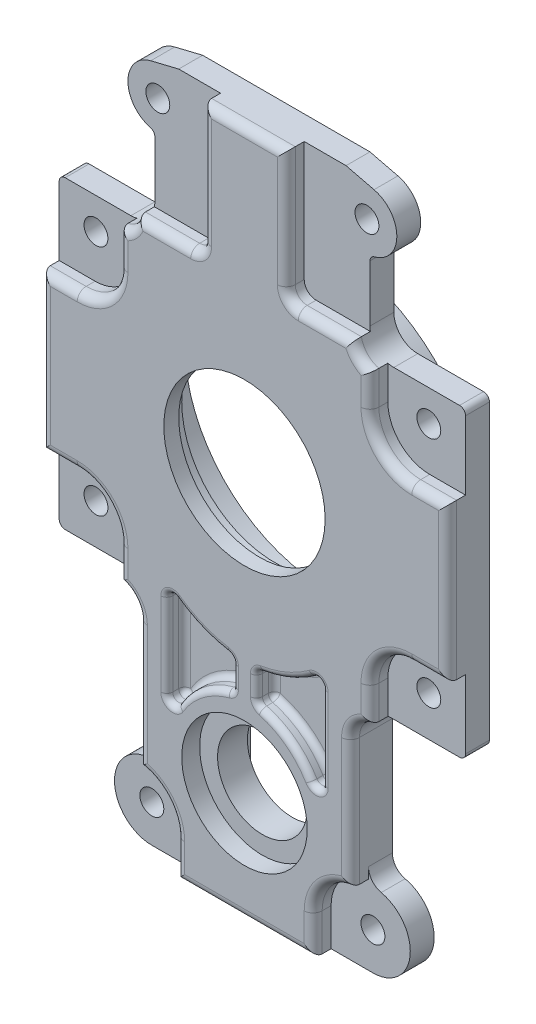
from build123d import *

# Parameters (mm, degrees)
ESQUISSE1_R             = 2
BASE_EXTRUSION_DEPTH    = 3
ESQUISSE2_R             = 10.5
BOSS_EXTRU_1_DEPTH      = 3
CONG_1_R                = 1.5
CONG_2_R                = 1
ESQUISSE6_R             = 26.25
BOSS_EXTRU_2_DEPTH      = 7.5
BOSS_EXTRU_3_DEPTH      = 2
ESQUISSE10_W            = 2
ESQUISSE10_H            = 18
BOSS_EXTRU_4_DEPTH      = 3
PER_AGE1_D              = 14
PER_AGE1_CBORE_D        = 15
PER_AGE1_CBORE_DEPTH    = 32
CONG_3_R                = 1
BOSS_EXTRU_5_START      = 1
BOSS_EXTRU_5_DEPTH      = 1
ESQUISSE12_R            = 2
ENL_V_MAT_EXTRU_1_DEPTH = 120.424662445


with BuildPart() as part:
    # Esquisse1 → Base-Extrusion (new body)
    with BuildSketch(Plane.XY):
        with BuildLine():
            Line((18, 92.75), (18, 102.190524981))
            ThreePointArc((18, 102.190524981), (18.209430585, 102.802897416), (18.75, 103.158770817))
            ThreePointArc((18.75, 103.158770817), (22.499886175, 108.033737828), (18.684554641, 112.857656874))
            Line((18.684554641, 112.857656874), (14, 114))
            Line((14, 114), (0, 114))
            Line((0, 114), (-14, 114))
            Line((-14, 114), (-18.684554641, 112.857656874))
            ThreePointArc((-18.684554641, 112.857656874), (-22.499886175, 108.033737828), (-18.75, 103.158770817))
            ThreePointArc((-18.75, 103.158770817), (-18.209430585, 102.802897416), (-18, 102.190524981))
            Line((-18, 102.190524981), (-18, 92.75))
            ThreePointArc((-18, 92.75), (-19.171572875, 89.921572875), (-22, 88.75))
            Line((-22, 88.75), (-33, 88.75))
            ThreePointArc((-33, 88.75), (-33.707106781, 88.457106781), (-34, 87.75))
            Line((-34, 87.75), (-34, 38.75))
            ThreePointArc((-34, 38.75), (-33.707106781, 38.042893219), (-33, 37.75))
            Line((-33, 37.75), (-30.5, 37.75))
            Line((-30.5, 37.75), (-21.75, 37.75))
            ThreePointArc((-21.75, 37.75), (-18.921572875, 36.578427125), (-17.75, 33.75))
            Line((-17.75, 33.75), (-17.75, 14.274964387))
            ThreePointArc((-17.75, 14.274964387), (-18.35022611, 12.560038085), (-19.888888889, 11.593725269))
            ThreePointArc((-19.888888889, 11.593725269), (-24.710808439, 4.801173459), (-18.5, -0.75))
            Line((-18.5, -0.75), (18.5, -0.75))
            ThreePointArc((18.5, -0.75), (24.710808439, 4.801173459), (19.888888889, 11.593725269))
            ThreePointArc((19.888888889, 11.593725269), (18.35022611, 12.560038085), (17.75, 14.274964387))
            Line((17.75, 14.274964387), (17.75, 33.75))
            ThreePointArc((17.75, 33.75), (18.921572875, 36.578427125), (21.75, 37.75))
            Line((21.75, 37.75), (30.5, 37.75))
            Line((30.5, 37.75), (33, 37.75))
            ThreePointArc((33, 37.75), (33.707106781, 38.042893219), (34, 38.75))
            Line((34, 38.75), (34, 87.75))
            ThreePointArc((34, 87.75), (33.707106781, 88.457106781), (33, 88.75))
            Line((33, 88.75), (22, 88.75))
            ThreePointArc((22, 88.75), (19.171572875, 89.921572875), (18, 92.75))
        make_face()
        with Locations(Location((-18.5, 5.5, 0), (0, 0, 180))):
            Circle(ESQUISSE1_R, mode=Mode.SUBTRACT)
        with Locations(Location((-27.851169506, 44.498401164, 0), (0, 0, 180))):
            Circle(ESQUISSE1_R, mode=Mode.SUBTRACT)
        with Locations(Location((27.851169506, 44.498401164, 0), (0, 0, 180))):
            Circle(ESQUISSE1_R, mode=Mode.SUBTRACT)
        with Locations(Location((18.5, 5.5, 0), (0, 0, 180))):
            Circle(ESQUISSE1_R, mode=Mode.SUBTRACT)
        with Locations(Location((17.5, 108, 0), (0, 0, 180))):
            Circle(ESQUISSE1_R, mode=Mode.SUBTRACT)
        with Locations(Location((-17.5, 108, 0), (0, 0, 180))):
            Circle(ESQUISSE1_R, mode=Mode.SUBTRACT)
        with Locations(Location((-27.851169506, 83.501598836, 0), (0, 0, 180))):
            Circle(ESQUISSE1_R, mode=Mode.SUBTRACT)
        with Locations(Location((27.851169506, 83.501598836, 0), (0, 0, 180))):
            Circle(ESQUISSE1_R, mode=Mode.SUBTRACT)
    extrude(amount=BASE_EXTRUSION_DEPTH)

    # Esquisse2 → Boss.-Extru.1 (add)
    with BuildSketch(Plane.XY.offset(3)):
        with BuildLine():
            Line((7, 114), (-7, 114))
            Line((-7, 114), (-7, 94))
            ThreePointArc((-7, 94), (-7.585786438, 92.585786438), (-9, 92))
            Line((-9, 92), (-18.070941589, 92))
            ThreePointArc((-18.070941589, 92), (-19.082439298, 90.013608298), (-21, 88.877016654))
            Line((-21, 88.877016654), (-21, 83.25))
            ThreePointArc((-21, 83.25), (-23.050252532, 78.300252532), (-28, 76.25))
            Line((-28, 76.25), (-34, 76.25))
            Line((-34, 76.25), (-34, 50.25))
            Line((-34, 50.25), (-28, 50.25))
            ThreePointArc((-28, 50.25), (-23.050252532, 48.199747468), (-21, 43.25))
            Line((-21, 43.25), (-21, 37.679058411))
            ThreePointArc((-21, 37.679058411), (-18.667792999, 36.299509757), (-17.75, 33.75))
            Line((-17.75, 33.75), (-17.75, 12.459705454))
            ThreePointArc((-17.75, 12.459705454), (-13.291833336, 10.177071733), (-11.5, 5.5))
            Line((-11.5, 5.5), (-11.5, -0.75))
            Line((-11.5, -0.75), (11.5, -0.75))
            Line((11.5, -0.75), (11.5, 5.5))
            ThreePointArc((11.5, 5.5), (13.291833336, 10.177071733), (17.75, 12.459705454))
            Line((17.75, 12.459705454), (17.75, 14.553916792))
            Line((17.75, 14.553916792), (17.75, 33.75))
            ThreePointArc((17.75, 33.75), (18.667792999, 36.299509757), (21, 37.679058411))
            Line((21, 37.679058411), (21, 43.25))
            ThreePointArc((21, 43.25), (23.050252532, 48.199747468), (28, 50.25))
            Line((28, 50.25), (34, 50.25))
            Line((34, 50.25), (34, 76.25))
            Line((34, 76.25), (28, 76.25))
            ThreePointArc((28, 76.25), (23.050252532, 78.300252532), (21, 83.25))
            Line((21, 83.25), (21, 88.877016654))
            ThreePointArc((21, 88.877016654), (19.082439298, 90.013608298), (18.070941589, 92))
            Line((18.070941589, 92), (9, 92))
            ThreePointArc((9, 92), (7.585786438, 92.585786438), (7, 94))
            Line((7, 94), (7, 114))
        make_face()
        with Locations((0, 17.552965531)):
            Circle(ESQUISSE2_R, mode=Mode.SUBTRACT)
        with BuildLine():
            Line((-13, 39.1508697), (-13, 25.212825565))
            ThreePointArc((-13, 25.212825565), (-12.264778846, 24.248516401), (-11.140215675, 24.702168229))
            ThreePointArc((-11.140215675, 24.702168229), (-7.562721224, 28.708103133), (-2.740215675, 31.072298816))
            ThreePointArc((-2.740215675, 31.072298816), (-2.206342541, 31.429600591), (-2, 32.037965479))
            Line((-2, 32.037965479), (-2, 35.382087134))
            ThreePointArc((-2, 35.382087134), (-2.237962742, 36.029620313), (-2.838598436, 36.36897595))
            ThreePointArc((-2.838598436, 36.36897595), (-7.335667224, 37.658911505), (-11.410027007, 39.95829268))
            ThreePointArc((-11.410027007, 39.95829268), (-12.452784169, 40.042489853), (-13, 39.1508697))
        make_face(mode=Mode.SUBTRACT)
        with BuildLine():
            Line((13, 39.1508697), (13, 25.212825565))
            ThreePointArc((13, 25.212825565), (12.264778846, 24.248516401), (11.140215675, 24.702168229))
            ThreePointArc((11.140215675, 24.702168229), (7.562721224, 28.708103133), (2.740215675, 31.072298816))
            ThreePointArc((2.740215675, 31.072298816), (2.206342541, 31.429600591), (2, 32.037965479))
            Line((2, 32.037965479), (2, 35.382087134))
            ThreePointArc((2, 35.382087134), (2.237962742, 36.029620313), (2.838598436, 36.36897595))
            ThreePointArc((2.838598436, 36.36897595), (7.335667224, 37.658911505), (11.410027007, 39.95829268))
            ThreePointArc((11.410027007, 39.95829268), (12.452784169, 40.042489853), (13, 39.1508697))
        make_face(mode=Mode.SUBTRACT)
    extrude(amount=BOSS_EXTRU_1_DEPTH)

    # Cong_1
    cong_1_edges = [part.edges().sort_by_distance(p)[0] for p in [
        (17.75, 23.104852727, 6),
        (18.667792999, 36.299509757, 6),
        (34, 63.25, 6),
        (19.082439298, 90.013608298, 6),
        (0, 114, 6),
        (-19.082439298, 90.013608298, 6),
        (-34, 63.25, 6),
        (-18.667792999, 36.299509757, 6),
        (-17.75, 23.104852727, 6),
        (-11.5, 2.375, 6),
        (-13.291833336, 10.177071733, 6),
        (-21, 40.464529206, 6),
        (-23.050252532, 48.199747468, 6),
        (-31, 50.25, 6),
        (-31, 76.25, 6),
        (-23.050252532, 78.300252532, 6),
        (-21, 86.063508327, 6),
        (-13.535470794, 92, 6),
        (-7.585786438, 92.585786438, 6),
        (-7, 104, 6),
        (7, 104, 6),
        (7.585786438, 92.585786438, 6),
        (13.535470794, 92, 6),
        (21, 86.063508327, 6),
        (23.050252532, 78.300252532, 6),
        (31, 76.25, 6),
        (31, 50.25, 6),
        (23.050252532, 48.199747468, 6),
        (21, 40.464529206, 6),
        (0, -0.75, 6),
        (11.5, 2.375, 6),
        (13.291833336, 10.177071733, 6),
    ]]
    fillet(cong_1_edges, radius=CONG_1_R)

    # Cong_2
    cong_2_edges = [part.edges().sort_by_distance(p)[0] for p in [
        (-2.237962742, 36.029620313, 6),
        (-2, 33.710026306, 6),
        (-2.206342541, 31.429600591, 6),
        (-7.562721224, 28.708103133, 6),
        (-12.264778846, 24.248516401, 6),
        (-13, 32.181847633, 6),
        (-12.452784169, 40.042489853, 6),
        (-7.335667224, 37.658911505, 6),
        (13, 32.181847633, 6),
        (12.264778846, 24.248516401, 6),
        (7.562721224, 28.708103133, 6),
        (2.206342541, 31.429600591, 6),
        (2, 33.710026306, 6),
        (2.237962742, 36.029620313, 6),
        (7.335667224, 37.658911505, 6),
        (12.452784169, 40.042489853, 6),
        (-2.237962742, 36.029620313, 3),
        (-2, 33.710026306, 3),
        (-2.206342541, 31.429600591, 3),
        (-7.562721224, 28.708103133, 3),
        (-12.264778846, 24.248516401, 3),
        (-13, 32.181847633, 3),
        (-12.452784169, 40.042489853, 3),
        (-7.335667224, 37.658911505, 3),
        (13, 32.181847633, 3),
        (12.264778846, 24.248516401, 3),
        (7.562721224, 28.708103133, 3),
        (2.206342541, 31.429600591, 3),
        (2, 33.710026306, 3),
        (2.237962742, 36.029620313, 3),
        (7.335667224, 37.658911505, 3),
        (12.452784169, 40.042489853, 3),
    ]]
    fillet(cong_2_edges, radius=CONG_2_R)

    # Esquisse6 → Boss.-Extru.2 (add)
    with BuildSketch(Plane(origin=(0, 0, 0), x_dir=(-1, 0, 0), z_dir=(0, 0, -1))):
        with Locations(Location((0, 64, 0), (0, 0, 242.797105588))):
            Circle(ESQUISSE6_R)
    extrude(amount=BOSS_EXTRU_2_DEPTH)

    # Esquisse8 → Enl_vement de mati_re-R_volution1 (revolve, cut)
    with BuildSketch(Plane(origin=(0, 0, 0), x_dir=(0, 0, -1), z_dir=(1, 0, 0)), mode=Mode.PRIVATE) as enl_vement_de_mati_re_r_volution1_sk:
        Polygon((7.5, 40.5), (-0.5, 40.5), (-0.5, 44.5), (-1, 44.5), (-1, 48.5), (-3.5, 48.5), (-3.5, 50.5), (-6, 50.5), (-6, 64), (7.5, 64), align=None)
    revolve(enl_vement_de_mati_re_r_volution1_sk.sketch.rotate(Axis((0, 64, 8), (0, 0, -1)), 270), axis=Axis((0, 64, 8), (0, 0, -1)), mode=Mode.SUBTRACT)

    # Esquisse9 → Boss.-Extru.3 (add)
    with BuildSketch(Plane(origin=(0, 0, 0), x_dir=(-1, 0, 0), z_dir=(0, 0, -1))):
        with BuildLine():
            Line((-12, 40.653426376), (-12, 9.25))
            ThreePointArc((-12, 9.25), (-9.949747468, 4.300252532), (-5, 2.25))
            Line((-5, 2.25), (5, 2.25))
            ThreePointArc((5, 2.25), (9.949747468, 4.300252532), (12, 9.25))
            Line((12, 9.25), (12, 40.653426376))
            ThreePointArc((12, 40.653426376), (0, 37.75), (-12, 40.653426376))
        make_face()
    extrude(amount=BOSS_EXTRU_3_DEPTH)

    # Esquisse10 → Boss.-Extru.4 (add)
    with BuildSketch(Plane(origin=(0, 0, -2), x_dir=(-1, 0, 0), z_dir=(0, 0, -1))):
        with Locations((-11, 20.25)):
            Rectangle(ESQUISSE10_W, ESQUISSE10_H)
        with Locations((11, 20.25)):
            Rectangle(ESQUISSE10_W, ESQUISSE10_H)
    extrude(amount=BOSS_EXTRU_4_DEPTH)

    # Per_age1 (through all)
    with Locations(Plane.XY.offset(3)):
        with Locations((0, 17.552965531)):
            CounterBoreHole(PER_AGE1_D / 2, PER_AGE1_CBORE_D / 2, PER_AGE1_CBORE_DEPTH)

    # Cong_3
    cong_3_edges = [part.edges().sort_by_distance(p)[0] for p in [
        (-10, 20.25, -2),
        (10, 20.25, -2),
    ]]
    fillet(cong_3_edges, radius=CONG_3_R)

    # Esquisse11 → Boss.-Extru.5 (add)
    with BuildSketch(Plane(origin=(0, 0, 0), x_dir=(-1, 0, 0), z_dir=(0, 0, -1)).offset(BOSS_EXTRU_5_START)):
        with BuildLine():
            Line((-18, 102.190524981), (-18, 92.75))
            ThreePointArc((-18, 92.75), (-19.171572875, 89.921572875), (-22, 88.75))
            Line((-22, 88.75), (-33, 88.75))
            ThreePointArc((-33, 88.75), (-33.707106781, 88.457106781), (-34, 87.75))
            Line((-34, 87.75), (-34, 38.75))
            ThreePointArc((-34, 38.75), (-33.707106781, 38.042893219), (-33, 37.75))
            Line((-33, 37.75), (-21.75, 37.75))
            ThreePointArc((-21.75, 37.75), (-18.921572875, 36.578427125), (-17.75, 33.75))
            Line((-17.75, 33.75), (-17.75, 14.274964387))
            ThreePointArc((-17.75, 14.274964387), (-18.35022611, 12.560038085), (-19.888888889, 11.593725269))
            ThreePointArc((-19.888888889, 11.593725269), (-24.710808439, 4.801173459), (-18.5, -0.75))
            Line((-18.5, -0.75), (18.5, -0.75))
            ThreePointArc((18.5, -0.75), (24.710808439, 4.801173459), (19.888888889, 11.593725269))
            ThreePointArc((19.888888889, 11.593725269), (18.35022611, 12.560038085), (17.75, 14.274964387))
            Line((17.75, 14.274964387), (17.75, 33.75))
            ThreePointArc((17.75, 33.75), (18.921572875, 36.578427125), (21.75, 37.75))
            Line((21.75, 37.75), (33, 37.75))
            ThreePointArc((33, 37.75), (33.707106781, 38.042893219), (34, 38.75))
            Line((34, 38.75), (34, 87.75))
            ThreePointArc((34, 87.75), (33.707106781, 88.457106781), (33, 88.75))
            Line((33, 88.75), (22, 88.75))
            ThreePointArc((22, 88.75), (19.171572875, 89.921572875), (18, 92.75))
            Line((18, 92.75), (18, 102.190524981))
            ThreePointArc((18, 102.190524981), (18.209430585, 102.802897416), (18.75, 103.158770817))
            ThreePointArc((18.75, 103.158770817), (22.499886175, 108.033737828), (18.684554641, 112.857656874))
            Line((18.684554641, 112.857656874), (14, 114))
            Line((14, 114), (-14, 114))
            Line((-14, 114), (-18.684554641, 112.857656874))
            ThreePointArc((-18.684554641, 112.857656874), (-22.499886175, 108.033737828), (-18.75, 103.158770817))
            ThreePointArc((-18.75, 103.158770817), (-18.209430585, 102.802897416), (-18, 102.190524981))
        make_face()
        with BuildLine():
            Line((-12, 40.653426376), (-12, 9.25))
            ThreePointArc((-12, 9.25), (-9.949747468, 4.300252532), (-5, 2.25))
            Line((-5, 2.25), (5, 2.25))
            ThreePointArc((5, 2.25), (9.949747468, 4.300252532), (12, 9.25))
            Line((12, 9.25), (12, 40.653426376))
            ThreePointArc((12, 40.653426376), (0, 90.25), (-12, 40.653426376))
        make_face(mode=Mode.SUBTRACT)
    extrude(amount=-BOSS_EXTRU_5_DEPTH)

    # Esquisse12 → Enl_v. mat.-Extru.1 (cut, through all)
    with BuildSketch(Plane.XY.offset(3)):
        with Locations(Location((18.5, 5.5, 0), (0, 0, 180))):
            Circle(ESQUISSE12_R)
        with Locations(Location((-18.5, 5.5, 0), (0, 0, 180))):
            Circle(ESQUISSE12_R)
        with Locations(Location((-27.851169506, 44.498401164, 0), (0, 0, 180))):
            Circle(ESQUISSE12_R)
        with Locations(Location((27.851169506, 44.498401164, 0), (0, 0, 180))):
            Circle(ESQUISSE12_R)
        with Locations(Location((-27.851169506, 83.501598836, 0), (0, 0, 180))):
            Circle(ESQUISSE12_R)
        with Locations(Location((27.851169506, 83.501598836, 0), (0, 0, 180))):
            Circle(ESQUISSE12_R)
        with Locations(Location((17.5, 108, 0), (0, 0, 180))):
            Circle(ESQUISSE12_R)
        with Locations(Location((-17.5, 108, 0), (0, 0, 180))):
            Circle(ESQUISSE12_R)
    extrude(amount=-ENL_V_MAT_EXTRU_1_DEPTH, mode=Mode.SUBTRACT)


solid = part.part
